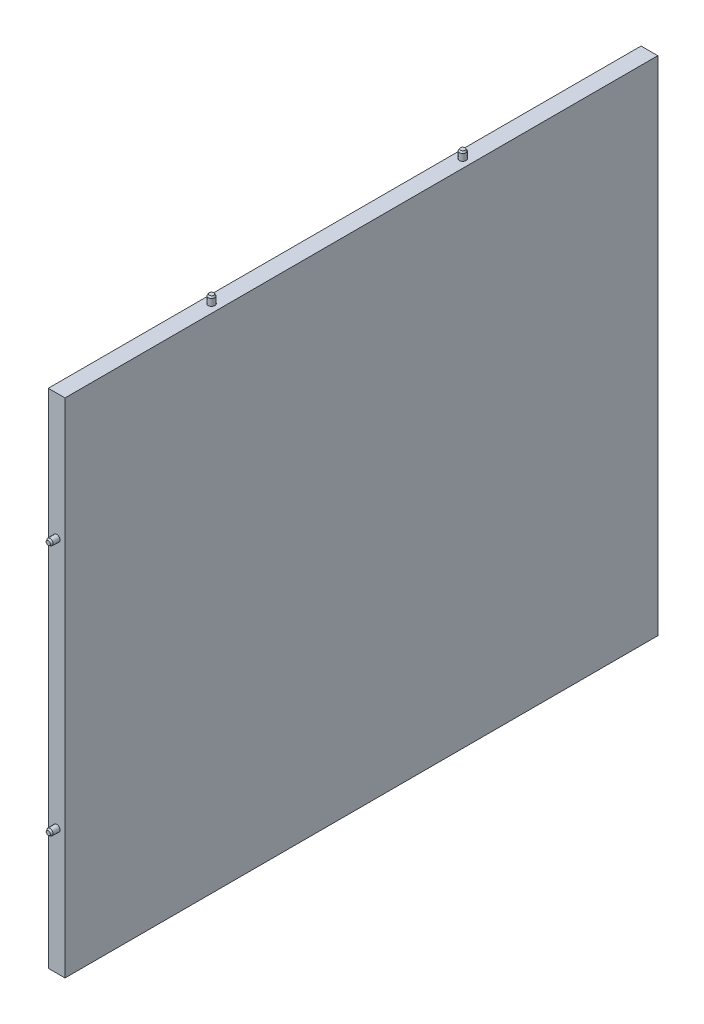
ISO-10303-21;
HEADER;
FILE_DESCRIPTION(('STEP AP214'),'2;1');
FILE_NAME('part.step','',(''),(''),'','','');
FILE_SCHEMA(('AUTOMOTIVE_DESIGN { 1 0 10303 214 1 1 1 1 }'));
ENDSEC;
DATA;
#1=APPLICATION_CONTEXT('core data for automotive mechanical design processes');
#2=APPLICATION_PROTOCOL_DEFINITION('international standard','automotive_design',2000,#1);
#3=PRODUCT_CONTEXT('',#1,'mechanical');
#4=PRODUCT('Part','Part','',(#3));
#5=PRODUCT_RELATED_PRODUCT_CATEGORY('part','',(#4));
#6=PRODUCT_DEFINITION_FORMATION('','',#4);
#7=PRODUCT_DEFINITION_CONTEXT('part definition',#1,'design');
#8=PRODUCT_DEFINITION('design','',#6,#7);
#9=PRODUCT_DEFINITION_SHAPE('','',#8);
#10=(LENGTH_UNIT() NAMED_UNIT(*) SI_UNIT(.MILLI.,.METRE.));
#11=(NAMED_UNIT(*) PLANE_ANGLE_UNIT() SI_UNIT($,.RADIAN.));
#12=(NAMED_UNIT(*) SI_UNIT($,.STERADIAN.) SOLID_ANGLE_UNIT());
#13=UNCERTAINTY_MEASURE_WITH_UNIT(LENGTH_MEASURE(1.E-05),#10,'distance_accuracy_value','');
#14=(GEOMETRIC_REPRESENTATION_CONTEXT(3) GLOBAL_UNCERTAINTY_ASSIGNED_CONTEXT((#13)) GLOBAL_UNIT_ASSIGNED_CONTEXT((#10,
#11,#12)) REPRESENTATION_CONTEXT('',''));
#15=CARTESIAN_POINT('',(0.,0.,0.));
#16=DIRECTION('',(0.,0.,1.));
#17=DIRECTION('',(1.,0.,0.));
#18=AXIS2_PLACEMENT_3D('',#15,#16,#17);
#19=CARTESIAN_POINT('',(10.,150.,162.5));
#20=DIRECTION('',(0.,-1.,0.));
#21=DIRECTION('',(0.,0.,-1.));
#22=AXIS2_PLACEMENT_3D('',#19,#20,#21);
#23=PLANE('',#22);
#24=CARTESIAN_POINT('',(5.,150.,70.));
#25=DIRECTION('',(0.,-1.,0.));
#26=DIRECTION('',(0.,0.,-1.));
#27=AXIS2_PLACEMENT_3D('',#24,#25,#26);
#28=CIRCLE('',#27,2.);
#29=CARTESIAN_POINT('',(5.,150.,68.));
#30=VERTEX_POINT('',#29);
#31=EDGE_CURVE('E139',#30,#30,#28,.F.);
#32=ORIENTED_EDGE('',*,*,#31,.F.);
#33=EDGE_LOOP('',(#32));
#34=FACE_BOUND('',#33,.T.);
#35=DIRECTION('',(0.,0.,1.));
#36=VECTOR('',#35,1.);
#37=CARTESIAN_POINT('',(0.,150.,162.5));
#38=LINE('',#37,#36);
#39=CARTESIAN_POINT('',(0.,150.,-191.5));
#40=VERTEX_POINT('',#39);
#41=CARTESIAN_POINT('',(0.,150.,162.5));
#42=VERTEX_POINT('',#41);
#43=EDGE_CURVE('E58',#40,#42,#38,.T.);
#44=ORIENTED_EDGE('',*,*,#43,.T.);
#45=DIRECTION('',(-1.,0.,0.));
#46=VECTOR('',#45,1.);
#47=CARTESIAN_POINT('',(10.,150.,162.5));
#48=LINE('',#47,#46);
#49=CARTESIAN_POINT('',(10.,150.,162.5));
#50=VERTEX_POINT('',#49);
#51=EDGE_CURVE('E131',#50,#42,#48,.T.);
#52=ORIENTED_EDGE('',*,*,#51,.F.);
#53=DIRECTION('',(0.,0.,1.));
#54=VECTOR('',#53,1.);
#55=CARTESIAN_POINT('',(10.,150.,162.5));
#56=LINE('',#55,#54);
#57=CARTESIAN_POINT('',(10.,150.,-191.5));
#58=VERTEX_POINT('',#57);
#59=EDGE_CURVE('E85',#58,#50,#56,.T.);
#60=ORIENTED_EDGE('',*,*,#59,.F.);
#61=DIRECTION('',(-1.,0.,0.));
#62=VECTOR('',#61,1.);
#63=CARTESIAN_POINT('',(10.,150.,-191.5));
#64=LINE('',#63,#62);
#65=EDGE_CURVE('E95',#58,#40,#64,.T.);
#66=ORIENTED_EDGE('',*,*,#65,.T.);
#67=EDGE_LOOP('',(#44,#52,#60,#66));
#68=FACE_BOUND('',#67,.T.);
#69=CARTESIAN_POINT('',(5.,150.,-80.));
#70=DIRECTION('',(0.,-1.,0.));
#71=DIRECTION('',(0.,0.,-1.));
#72=AXIS2_PLACEMENT_3D('',#69,#70,#71);
#73=CIRCLE('',#72,2.);
#74=CARTESIAN_POINT('',(5.,150.,-82.));
#75=VERTEX_POINT('',#74);
#76=EDGE_CURVE('E142',#75,#75,#73,.F.);
#77=ORIENTED_EDGE('',*,*,#76,.F.);
#78=EDGE_LOOP('',(#77));
#79=FACE_BOUND('',#78,.T.);
#80=ADVANCED_FACE('F30',(#34,#68,#79),#23,.F.);
#81=CARTESIAN_POINT('',(10.,-150.,162.5));
#82=DIRECTION('',(0.,0.,-1.));
#83=DIRECTION('',(-1.,0.,0.));
#84=AXIS2_PLACEMENT_3D('',#81,#82,#83);
#85=PLANE('',#84);
#86=CARTESIAN_POINT('',(5.00000000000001,75.,162.5));
#87=DIRECTION('',(0.,0.,-1.));
#88=DIRECTION('',(-1.,0.,0.));
#89=AXIS2_PLACEMENT_3D('',#86,#87,#88);
#90=CIRCLE('',#89,2.);
#91=CARTESIAN_POINT('',(3.00000000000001,75.,162.5));
#92=VERTEX_POINT('',#91);
#93=EDGE_CURVE('E133',#92,#92,#90,.F.);
#94=ORIENTED_EDGE('',*,*,#93,.F.);
#95=EDGE_LOOP('',(#94));
#96=FACE_BOUND('',#95,.T.);
#97=DIRECTION('',(0.,-1.,0.));
#98=VECTOR('',#97,1.);
#99=CARTESIAN_POINT('',(0.,-150.,162.5));
#100=LINE('',#99,#98);
#101=CARTESIAN_POINT('',(0.,-150.,162.5));
#102=VERTEX_POINT('',#101);
#103=EDGE_CURVE('E86',#42,#102,#100,.T.);
#104=ORIENTED_EDGE('',*,*,#103,.T.);
#105=DIRECTION('',(-1.,0.,0.));
#106=VECTOR('',#105,1.);
#107=CARTESIAN_POINT('',(10.,-150.,162.5));
#108=LINE('',#107,#106);
#109=CARTESIAN_POINT('',(10.,-150.,162.5));
#110=VERTEX_POINT('',#109);
#111=EDGE_CURVE('E81',#110,#102,#108,.T.);
#112=ORIENTED_EDGE('',*,*,#111,.F.);
#113=DIRECTION('',(0.,-1.,0.));
#114=VECTOR('',#113,1.);
#115=CARTESIAN_POINT('',(10.,-150.,162.5));
#116=LINE('',#115,#114);
#117=EDGE_CURVE('E47',#50,#110,#116,.T.);
#118=ORIENTED_EDGE('',*,*,#117,.F.);
#119=ORIENTED_EDGE('',*,*,#51,.T.);
#120=EDGE_LOOP('',(#104,#112,#118,#119));
#121=FACE_BOUND('',#120,.T.);
#122=CARTESIAN_POINT('',(5.00000000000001,-75.,162.5));
#123=DIRECTION('',(0.,0.,-1.));
#124=DIRECTION('',(-1.,0.,0.));
#125=AXIS2_PLACEMENT_3D('',#122,#123,#124);
#126=CIRCLE('',#125,2.);
#127=CARTESIAN_POINT('',(3.00000000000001,-75.,162.5));
#128=VERTEX_POINT('',#127);
#129=EDGE_CURVE('E136',#128,#128,#126,.F.);
#130=ORIENTED_EDGE('',*,*,#129,.F.);
#131=EDGE_LOOP('',(#130));
#132=FACE_BOUND('',#131,.T.);
#133=ADVANCED_FACE('F179',(#96,#121,#132),#85,.F.);
#134=CARTESIAN_POINT('',(10.,-150.,162.5));
#135=DIRECTION('',(0.,1.,0.));
#136=DIRECTION('',(0.,0.,1.));
#137=AXIS2_PLACEMENT_3D('',#134,#135,#136);
#138=PLANE('',#137);
#139=DIRECTION('',(0.,0.,-1.));
#140=VECTOR('',#139,1.);
#141=CARTESIAN_POINT('',(0.,-150.,162.5));
#142=LINE('',#141,#140);
#143=CARTESIAN_POINT('',(0.,-150.,-191.5));
#144=VERTEX_POINT('',#143);
#145=EDGE_CURVE('E76',#102,#144,#142,.T.);
#146=ORIENTED_EDGE('',*,*,#145,.T.);
#147=DIRECTION('',(-1.,0.,0.));
#148=VECTOR('',#147,1.);
#149=CARTESIAN_POINT('',(10.,-150.,-191.5));
#150=LINE('',#149,#148);
#151=CARTESIAN_POINT('',(10.,-150.,-191.5));
#152=VERTEX_POINT('',#151);
#153=EDGE_CURVE('E79',#152,#144,#150,.T.);
#154=ORIENTED_EDGE('',*,*,#153,.F.);
#155=DIRECTION('',(0.,0.,-1.));
#156=VECTOR('',#155,1.);
#157=CARTESIAN_POINT('',(10.,-150.,162.5));
#158=LINE('',#157,#156);
#159=EDGE_CURVE('E65',#110,#152,#158,.T.);
#160=ORIENTED_EDGE('',*,*,#159,.F.);
#161=ORIENTED_EDGE('',*,*,#111,.T.);
#162=EDGE_LOOP('',(#146,#154,#160,#161));
#163=FACE_BOUND('',#162,.T.);
#164=ADVANCED_FACE('F78',(#163),#138,.F.);
#165=CARTESIAN_POINT('',(10.,150.,-162.5));
#166=DIRECTION('',(-1.,0.,0.));
#167=DIRECTION('',(0.,0.,1.));
#168=AXIS2_PLACEMENT_3D('',#165,#166,#167);
#169=PLANE('',#168);
#170=ORIENTED_EDGE('',*,*,#159,.T.);
#171=DIRECTION('',(0.,-1.,0.));
#172=VECTOR('',#171,1.);
#173=CARTESIAN_POINT('',(10.,150.,-191.5));
#174=LINE('',#173,#172);
#175=EDGE_CURVE('E93',#58,#152,#174,.T.);
#176=ORIENTED_EDGE('',*,*,#175,.F.);
#177=ORIENTED_EDGE('',*,*,#59,.T.);
#178=ORIENTED_EDGE('',*,*,#117,.T.);
#179=EDGE_LOOP('',(#170,#176,#177,#178));
#180=FACE_BOUND('',#179,.T.);
#181=ADVANCED_FACE('F219',(#180),#169,.F.);
#182=CARTESIAN_POINT('',(0.,150.,-162.5));
#183=DIRECTION('',(-1.,0.,0.));
#184=DIRECTION('',(0.,0.,1.));
#185=AXIS2_PLACEMENT_3D('',#182,#183,#184);
#186=PLANE('',#185);
#187=CARTESIAN_POINT('',(0.,75.,-100.));
#188=DIRECTION('',(-1.,0.,0.));
#189=DIRECTION('',(0.,0.,-1.));
#190=AXIS2_PLACEMENT_3D('',#187,#188,#189);
#191=CIRCLE('',#190,2.);
#192=CARTESIAN_POINT('',(0.,75.,-102.));
#193=VERTEX_POINT('',#192);
#194=EDGE_CURVE('E94',#193,#193,#191,.T.);
#195=ORIENTED_EDGE('',*,*,#194,.F.);
#196=EDGE_LOOP('',(#195));
#197=FACE_BOUND('',#196,.T.);
#198=CARTESIAN_POINT('',(0.,75.,100.));
#199=DIRECTION('',(-1.,0.,0.));
#200=DIRECTION('',(0.,0.,1.));
#201=AXIS2_PLACEMENT_3D('',#198,#199,#200);
#202=CIRCLE('',#201,2.);
#203=CARTESIAN_POINT('',(0.,75.,102.));
#204=VERTEX_POINT('',#203);
#205=EDGE_CURVE('E105',#204,#204,#202,.T.);
#206=ORIENTED_EDGE('',*,*,#205,.F.);
#207=EDGE_LOOP('',(#206));
#208=FACE_BOUND('',#207,.T.);
#209=CARTESIAN_POINT('',(0.,-75.,100.));
#210=DIRECTION('',(-1.,0.,0.));
#211=DIRECTION('',(0.,0.,-1.));
#212=AXIS2_PLACEMENT_3D('',#209,#210,#211);
#213=CIRCLE('',#212,2.);
#214=CARTESIAN_POINT('',(0.,-75.,98.));
#215=VERTEX_POINT('',#214);
#216=EDGE_CURVE('E111',#215,#215,#213,.T.);
#217=ORIENTED_EDGE('',*,*,#216,.F.);
#218=EDGE_LOOP('',(#217));
#219=FACE_BOUND('',#218,.T.);
#220=CARTESIAN_POINT('',(0.,-75.,-100.));
#221=DIRECTION('',(-1.,0.,0.));
#222=DIRECTION('',(0.,0.,1.));
#223=AXIS2_PLACEMENT_3D('',#220,#221,#222);
#224=CIRCLE('',#223,2.);
#225=CARTESIAN_POINT('',(0.,-75.,-98.));
#226=VERTEX_POINT('',#225);
#227=EDGE_CURVE('E117',#226,#226,#224,.T.);
#228=ORIENTED_EDGE('',*,*,#227,.F.);
#229=EDGE_LOOP('',(#228));
#230=FACE_BOUND('',#229,.T.);
#231=ORIENTED_EDGE('',*,*,#43,.F.);
#232=DIRECTION('',(0.,-1.,0.));
#233=VECTOR('',#232,1.);
#234=CARTESIAN_POINT('',(0.,150.,-191.5));
#235=LINE('',#234,#233);
#236=EDGE_CURVE('E92',#40,#144,#235,.T.);
#237=ORIENTED_EDGE('',*,*,#236,.T.);
#238=ORIENTED_EDGE('',*,*,#145,.F.);
#239=ORIENTED_EDGE('',*,*,#103,.F.);
#240=EDGE_LOOP('',(#231,#237,#238,#239));
#241=FACE_BOUND('',#240,.T.);
#242=ADVANCED_FACE('F97',(#197,#208,#219,#230,#241),#186,.T.);
#243=CARTESIAN_POINT('',(5.00000000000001,75.,162.5));
#244=DIRECTION('',(0.,0.,-1.));
#245=DIRECTION('',(1.,0.,0.));
#246=AXIS2_PLACEMENT_3D('',#243,#244,#245);
#247=CONICAL_SURFACE('',#246,2.,0.0349065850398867);
#248=CARTESIAN_POINT('',(5.00000000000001,75.,166.500609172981));
#249=DIRECTION('',(0.,0.,-1.));
#250=DIRECTION('',(-1.,0.,0.));
#251=AXIS2_PLACEMENT_3D('',#248,#249,#250);
#252=CIRCLE('',#251,1.86029564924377);
#253=CARTESIAN_POINT('',(3.13970435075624,75.,166.500609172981));
#254=VERTEX_POINT('',#253);
#255=EDGE_CURVE('E154',#254,#254,#252,.T.);
#256=ORIENTED_EDGE('',*,*,#255,.T.);
#257=EDGE_LOOP('',(#256));
#258=FACE_BOUND('',#257,.T.);
#259=ORIENTED_EDGE('',*,*,#93,.T.);
#260=EDGE_LOOP('',(#259));
#261=FACE_BOUND('',#260,.T.);
#262=ADVANCED_FACE('F206',(#258,#261),#247,.T.);
#263=CARTESIAN_POINT('',(5.00000000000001,75.,167.5));
#264=DIRECTION('',(0.,0.,1.));
#265=DIRECTION('',(1.,0.,0.));
#266=AXIS2_PLACEMENT_3D('',#263,#264,#265);
#267=PLANE('',#266);
#268=CARTESIAN_POINT('',(5.00000000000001,75.,167.5));
#269=DIRECTION('',(0.,0.,1.));
#270=DIRECTION('',(1.,0.,0.));
#271=AXIS2_PLACEMENT_3D('',#268,#269,#270);
#272=CIRCLE('',#271,1.23580695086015);
#273=CARTESIAN_POINT('',(6.23580695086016,75.,167.5));
#274=VERTEX_POINT('',#273);
#275=EDGE_CURVE('E151',#274,#274,#272,.T.);
#276=ORIENTED_EDGE('',*,*,#275,.T.);
#277=EDGE_LOOP('',(#276));
#278=FACE_BOUND('',#277,.T.);
#279=ADVANCED_FACE('F203',(#278),#267,.T.);
#280=CARTESIAN_POINT('',(5.00000000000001,-75.,162.5));
#281=DIRECTION('',(0.,0.,-1.));
#282=DIRECTION('',(-1.,0.,0.));
#283=AXIS2_PLACEMENT_3D('',#280,#281,#282);
#284=CONICAL_SURFACE('',#283,2.,0.0349065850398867);
#285=CARTESIAN_POINT('',(5.00000000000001,-75.,166.500609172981));
#286=DIRECTION('',(0.,0.,1.));
#287=DIRECTION('',(1.,0.,0.));
#288=AXIS2_PLACEMENT_3D('',#285,#286,#287);
#289=CIRCLE('',#288,1.86029564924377);
#290=CARTESIAN_POINT('',(6.86029564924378,-75.,166.500609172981));
#291=VERTEX_POINT('',#290);
#292=EDGE_CURVE('E148',#291,#291,#289,.F.);
#293=ORIENTED_EDGE('',*,*,#292,.T.);
#294=EDGE_LOOP('',(#293));
#295=FACE_BOUND('',#294,.T.);
#296=ORIENTED_EDGE('',*,*,#129,.T.);
#297=EDGE_LOOP('',(#296));
#298=FACE_BOUND('',#297,.T.);
#299=ADVANCED_FACE('F205',(#295,#298),#284,.T.);
#300=CARTESIAN_POINT('',(5.00000000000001,-75.,167.5));
#301=DIRECTION('',(0.,0.,-1.));
#302=DIRECTION('',(-1.,0.,0.));
#303=AXIS2_PLACEMENT_3D('',#300,#301,#302);
#304=PLANE('',#303);
#305=CARTESIAN_POINT('',(5.00000000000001,-75.,167.5));
#306=DIRECTION('',(0.,0.,-1.));
#307=DIRECTION('',(-1.,0.,0.));
#308=AXIS2_PLACEMENT_3D('',#305,#306,#307);
#309=CIRCLE('',#308,1.23580695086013);
#310=CARTESIAN_POINT('',(3.76419304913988,-75.,167.5));
#311=VERTEX_POINT('',#310);
#312=EDGE_CURVE('E145',#311,#311,#309,.F.);
#313=ORIENTED_EDGE('',*,*,#312,.T.);
#314=EDGE_LOOP('',(#313));
#315=FACE_BOUND('',#314,.T.);
#316=ADVANCED_FACE('F212',(#315),#304,.F.);
#317=CARTESIAN_POINT('',(5.,150.,70.));
#318=DIRECTION('',(0.,-1.,0.));
#319=DIRECTION('',(0.,0.,1.));
#320=AXIS2_PLACEMENT_3D('',#317,#318,#319);
#321=CONICAL_SURFACE('',#320,2.,0.0174532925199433);
#322=CARTESIAN_POINT('',(5.,154.000152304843,70.));
#323=DIRECTION('',(0.,-1.,0.));
#324=DIRECTION('',(0.,0.,-1.));
#325=AXIS2_PLACEMENT_3D('',#322,#323,#324);
#326=CIRCLE('',#325,1.9301770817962);
#327=CARTESIAN_POINT('',(5.,154.000152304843,68.0698229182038));
#328=VERTEX_POINT('',#327);
#329=EDGE_CURVE('E160',#328,#328,#326,.T.);
#330=ORIENTED_EDGE('',*,*,#329,.T.);
#331=EDGE_LOOP('',(#330));
#332=FACE_BOUND('',#331,.T.);
#333=ORIENTED_EDGE('',*,*,#31,.T.);
#334=EDGE_LOOP('',(#333));
#335=FACE_BOUND('',#334,.T.);
#336=ADVANCED_FACE('F267',(#332,#335),#321,.T.);
#337=CARTESIAN_POINT('',(5.,155.,70.));
#338=DIRECTION('',(0.,1.,0.));
#339=DIRECTION('',(0.,0.,1.));
#340=AXIS2_PLACEMENT_3D('',#337,#338,#339);
#341=PLANE('',#340);
#342=CARTESIAN_POINT('',(5.,155.,70.));
#343=DIRECTION('',(0.,1.,0.));
#344=DIRECTION('',(0.,0.,1.));
#345=AXIS2_PLACEMENT_3D('',#342,#343,#344);
#346=CIRCLE('',#345,1.32940797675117);
#347=CARTESIAN_POINT('',(5.,155.,71.3294079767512));
#348=VERTEX_POINT('',#347);
#349=EDGE_CURVE('E157',#348,#348,#346,.T.);
#350=ORIENTED_EDGE('',*,*,#349,.T.);
#351=EDGE_LOOP('',(#350));
#352=FACE_BOUND('',#351,.T.);
#353=ADVANCED_FACE('F277',(#352),#341,.T.);
#354=CARTESIAN_POINT('',(5.,150.,-80.));
#355=DIRECTION('',(0.,-1.,0.));
#356=DIRECTION('',(0.,0.,-1.));
#357=AXIS2_PLACEMENT_3D('',#354,#355,#356);
#358=CONICAL_SURFACE('',#357,2.,0.0174532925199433);
#359=CARTESIAN_POINT('',(5.,154.000152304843,-80.));
#360=DIRECTION('',(0.,1.,0.));
#361=DIRECTION('',(0.,0.,1.));
#362=AXIS2_PLACEMENT_3D('',#359,#360,#361);
#363=CIRCLE('',#362,1.9301770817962);
#364=CARTESIAN_POINT('',(5.,154.000152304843,-78.0698229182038));
#365=VERTEX_POINT('',#364);
#366=EDGE_CURVE('E11',#365,#365,#363,.F.);
#367=ORIENTED_EDGE('',*,*,#366,.T.);
#368=EDGE_LOOP('',(#367));
#369=FACE_BOUND('',#368,.T.);
#370=ORIENTED_EDGE('',*,*,#76,.T.);
#371=EDGE_LOOP('',(#370));
#372=FACE_BOUND('',#371,.T.);
#373=ADVANCED_FACE('F287',(#369,#372),#358,.T.);
#374=CARTESIAN_POINT('',(5.,155.,-80.));
#375=DIRECTION('',(0.,-1.,0.));
#376=DIRECTION('',(0.,0.,-1.));
#377=AXIS2_PLACEMENT_3D('',#374,#375,#376);
#378=PLANE('',#377);
#379=CARTESIAN_POINT('',(5.,155.,-80.));
#380=DIRECTION('',(0.,-1.,0.));
#381=DIRECTION('',(0.,0.,-1.));
#382=AXIS2_PLACEMENT_3D('',#379,#380,#381);
#383=CIRCLE('',#382,1.32940797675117);
#384=CARTESIAN_POINT('',(5.,155.,-81.3294079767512));
#385=VERTEX_POINT('',#384);
#386=EDGE_CURVE('E39',#385,#385,#383,.F.);
#387=ORIENTED_EDGE('',*,*,#386,.T.);
#388=EDGE_LOOP('',(#387));
#389=FACE_BOUND('',#388,.T.);
#390=ADVANCED_FACE('F165',(#389),#378,.F.);
#391=CARTESIAN_POINT('',(5.,-75.,-100.));
#392=DIRECTION('',(-1.,0.,0.));
#393=DIRECTION('',(0.,0.,1.));
#394=AXIS2_PLACEMENT_3D('',#391,#392,#393);
#395=CYLINDRICAL_SURFACE('',#394,2.);
#396=CARTESIAN_POINT('',(5.,-75.,-100.));
#397=DIRECTION('',(-1.,0.,0.));
#398=DIRECTION('',(0.,0.,1.));
#399=AXIS2_PLACEMENT_3D('',#396,#397,#398);
#400=CIRCLE('',#399,2.);
#401=CARTESIAN_POINT('',(5.,-75.,-98.));
#402=VERTEX_POINT('',#401);
#403=EDGE_CURVE('E120',#402,#402,#400,.T.);
#404=ORIENTED_EDGE('',*,*,#403,.F.);
#405=EDGE_LOOP('',(#404));
#406=FACE_BOUND('',#405,.T.);
#407=ORIENTED_EDGE('',*,*,#227,.T.);
#408=EDGE_LOOP('',(#407));
#409=FACE_BOUND('',#408,.T.);
#410=ADVANCED_FACE('F306',(#406,#409),#395,.F.);
#411=CARTESIAN_POINT('',(5.,-75.,-100.));
#412=DIRECTION('',(-1.,0.,0.));
#413=DIRECTION('',(0.,0.,1.));
#414=AXIS2_PLACEMENT_3D('',#411,#412,#413);
#415=PLANE('',#414);
#416=ORIENTED_EDGE('',*,*,#403,.T.);
#417=EDGE_LOOP('',(#416));
#418=FACE_BOUND('',#417,.T.);
#419=ADVANCED_FACE('F364',(#418),#415,.T.);
#420=CARTESIAN_POINT('',(5.,-75.,100.));
#421=DIRECTION('',(-1.,0.,0.));
#422=DIRECTION('',(0.,0.,1.));
#423=AXIS2_PLACEMENT_3D('',#420,#421,#422);
#424=CYLINDRICAL_SURFACE('',#423,2.);
#425=CARTESIAN_POINT('',(5.,-75.,100.));
#426=DIRECTION('',(-1.,0.,0.));
#427=DIRECTION('',(0.,0.,-1.));
#428=AXIS2_PLACEMENT_3D('',#425,#426,#427);
#429=CIRCLE('',#428,2.);
#430=CARTESIAN_POINT('',(5.,-75.,98.));
#431=VERTEX_POINT('',#430);
#432=EDGE_CURVE('E114',#431,#431,#429,.T.);
#433=ORIENTED_EDGE('',*,*,#432,.F.);
#434=EDGE_LOOP('',(#433));
#435=FACE_BOUND('',#434,.T.);
#436=ORIENTED_EDGE('',*,*,#216,.T.);
#437=EDGE_LOOP('',(#436));
#438=FACE_BOUND('',#437,.T.);
#439=ADVANCED_FACE('F374',(#435,#438),#424,.F.);
#440=CARTESIAN_POINT('',(5.,-75.,100.));
#441=DIRECTION('',(1.,0.,0.));
#442=DIRECTION('',(0.,0.,-1.));
#443=AXIS2_PLACEMENT_3D('',#440,#441,#442);
#444=PLANE('',#443);
#445=ORIENTED_EDGE('',*,*,#432,.T.);
#446=EDGE_LOOP('',(#445));
#447=FACE_BOUND('',#446,.T.);
#448=ADVANCED_FACE('F384',(#447),#444,.F.);
#449=CARTESIAN_POINT('',(5.,75.,100.));
#450=DIRECTION('',(-1.,0.,0.));
#451=DIRECTION('',(0.,0.,1.));
#452=AXIS2_PLACEMENT_3D('',#449,#450,#451);
#453=CYLINDRICAL_SURFACE('',#452,2.);
#454=CARTESIAN_POINT('',(5.,75.,100.));
#455=DIRECTION('',(-1.,0.,0.));
#456=DIRECTION('',(0.,0.,1.));
#457=AXIS2_PLACEMENT_3D('',#454,#455,#456);
#458=CIRCLE('',#457,2.);
#459=CARTESIAN_POINT('',(5.,75.,102.));
#460=VERTEX_POINT('',#459);
#461=EDGE_CURVE('E108',#460,#460,#458,.T.);
#462=ORIENTED_EDGE('',*,*,#461,.F.);
#463=EDGE_LOOP('',(#462));
#464=FACE_BOUND('',#463,.T.);
#465=ORIENTED_EDGE('',*,*,#205,.T.);
#466=EDGE_LOOP('',(#465));
#467=FACE_BOUND('',#466,.T.);
#468=ADVANCED_FACE('F394',(#464,#467),#453,.F.);
#469=CARTESIAN_POINT('',(5.,75.,100.));
#470=DIRECTION('',(-1.,0.,0.));
#471=DIRECTION('',(0.,0.,1.));
#472=AXIS2_PLACEMENT_3D('',#469,#470,#471);
#473=PLANE('',#472);
#474=ORIENTED_EDGE('',*,*,#461,.T.);
#475=EDGE_LOOP('',(#474));
#476=FACE_BOUND('',#475,.T.);
#477=ADVANCED_FACE('F404',(#476),#473,.T.);
#478=CARTESIAN_POINT('',(5.,75.,-100.));
#479=DIRECTION('',(-1.,0.,0.));
#480=DIRECTION('',(0.,0.,1.));
#481=AXIS2_PLACEMENT_3D('',#478,#479,#480);
#482=CYLINDRICAL_SURFACE('',#481,2.);
#483=CARTESIAN_POINT('',(5.,75.,-100.));
#484=DIRECTION('',(-1.,0.,0.));
#485=DIRECTION('',(0.,0.,-1.));
#486=AXIS2_PLACEMENT_3D('',#483,#484,#485);
#487=CIRCLE('',#486,2.);
#488=CARTESIAN_POINT('',(5.,75.,-102.));
#489=VERTEX_POINT('',#488);
#490=EDGE_CURVE('E102',#489,#489,#487,.T.);
#491=ORIENTED_EDGE('',*,*,#490,.F.);
#492=EDGE_LOOP('',(#491));
#493=FACE_BOUND('',#492,.T.);
#494=ORIENTED_EDGE('',*,*,#194,.T.);
#495=EDGE_LOOP('',(#494));
#496=FACE_BOUND('',#495,.T.);
#497=ADVANCED_FACE('F413',(#493,#496),#482,.F.);
#498=CARTESIAN_POINT('',(5.,75.,-100.));
#499=DIRECTION('',(1.,0.,0.));
#500=DIRECTION('',(0.,0.,-1.));
#501=AXIS2_PLACEMENT_3D('',#498,#499,#500);
#502=PLANE('',#501);
#503=ORIENTED_EDGE('',*,*,#490,.T.);
#504=EDGE_LOOP('',(#503));
#505=FACE_BOUND('',#504,.T.);
#506=ADVANCED_FACE('F193',(#505),#502,.F.);
#507=CARTESIAN_POINT('',(5.00000000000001,-75.,167.5));
#508=DIRECTION('',(0.,0.,-1.));
#509=DIRECTION('',(-1.,0.,0.));
#510=AXIS2_PLACEMENT_3D('',#507,#508,#509);
#511=CONICAL_SURFACE('',#510,1.23580695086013,0.558505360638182);
#512=ORIENTED_EDGE('',*,*,#292,.F.);
#513=EDGE_LOOP('',(#512));
#514=FACE_BOUND('',#513,.T.);
#515=ORIENTED_EDGE('',*,*,#312,.F.);
#516=EDGE_LOOP('',(#515));
#517=FACE_BOUND('',#516,.T.);
#518=ADVANCED_FACE('F190',(#514,#517),#511,.T.);
#519=CARTESIAN_POINT('',(5.00000000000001,75.,167.5));
#520=DIRECTION('',(0.,0.,-1.));
#521=DIRECTION('',(-1.,0.,0.));
#522=AXIS2_PLACEMENT_3D('',#519,#520,#521);
#523=CONICAL_SURFACE('',#522,1.23580695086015,0.558505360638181);
#524=ORIENTED_EDGE('',*,*,#255,.F.);
#525=EDGE_LOOP('',(#524));
#526=FACE_BOUND('',#525,.T.);
#527=ORIENTED_EDGE('',*,*,#275,.F.);
#528=EDGE_LOOP('',(#527));
#529=FACE_BOUND('',#528,.T.);
#530=ADVANCED_FACE('F175',(#526,#529),#523,.T.);
#531=CARTESIAN_POINT('',(5.,155.,70.));
#532=DIRECTION('',(0.,-1.,0.));
#533=DIRECTION('',(0.,0.,-1.));
#534=AXIS2_PLACEMENT_3D('',#531,#532,#533);
#535=CONICAL_SURFACE('',#534,1.32940797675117,0.541052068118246);
#536=ORIENTED_EDGE('',*,*,#329,.F.);
#537=EDGE_LOOP('',(#536));
#538=FACE_BOUND('',#537,.T.);
#539=ORIENTED_EDGE('',*,*,#349,.F.);
#540=EDGE_LOOP('',(#539));
#541=FACE_BOUND('',#540,.T.);
#542=ADVANCED_FACE('F168',(#538,#541),#535,.T.);
#543=CARTESIAN_POINT('',(5.,155.,-80.));
#544=DIRECTION('',(0.,-1.,0.));
#545=DIRECTION('',(0.,0.,-1.));
#546=AXIS2_PLACEMENT_3D('',#543,#544,#545);
#547=CONICAL_SURFACE('',#546,1.32940797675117,0.541052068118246);
#548=ORIENTED_EDGE('',*,*,#366,.F.);
#549=EDGE_LOOP('',(#548));
#550=FACE_BOUND('',#549,.T.);
#551=ORIENTED_EDGE('',*,*,#386,.F.);
#552=EDGE_LOOP('',(#551));
#553=FACE_BOUND('',#552,.T.);
#554=ADVANCED_FACE('F32',(#550,#553),#547,.T.);
#555=CARTESIAN_POINT('',(10.,150.,-191.5));
#556=DIRECTION('',(0.,0.,-1.));
#557=DIRECTION('',(0.,1.,0.));
#558=AXIS2_PLACEMENT_3D('',#555,#556,#557);
#559=PLANE('',#558);
#560=ORIENTED_EDGE('',*,*,#236,.F.);
#561=ORIENTED_EDGE('',*,*,#65,.F.);
#562=ORIENTED_EDGE('',*,*,#175,.T.);
#563=ORIENTED_EDGE('',*,*,#153,.T.);
#564=EDGE_LOOP('',(#560,#561,#562,#563));
#565=FACE_BOUND('',#564,.T.);
#566=ADVANCED_FACE('F90',(#565),#559,.T.);
#567=CLOSED_SHELL('',(#80,#133,#164,#181,#242,#262,#279,#299,#316,#336,#353,#373,#390,#410,#419,
#439,#448,#468,#477,#497,#506,#518,#530,#542,#554,#566));
#568=MANIFOLD_SOLID_BREP('B2',#567);
#569=ADVANCED_BREP_SHAPE_REPRESENTATION('',(#18,#568),#14);
#570=SHAPE_DEFINITION_REPRESENTATION(#9,#569);
ENDSEC;
END-ISO-10303-21;
